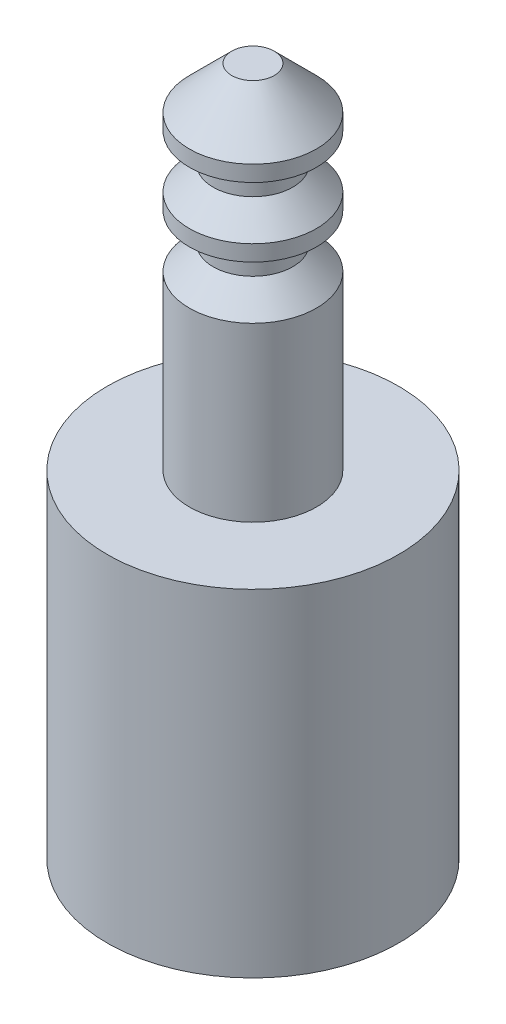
from build123d import *


with BuildPart() as part:
    # Sketch1 → Revolve1 (revolve)
    with BuildSketch(Plane.XY, mode=Mode.PRIVATE) as revolve1_sk:
        Polygon((2.75, 6.35), (1.2, 6.35), (1.2, 9.6), (0.75, 10.05), (0.75, 10.6), (1.2, 10.6), (1.2, 10.9), (0.75, 11.35), (0.75, 11.9), (1.2, 11.9), (1.2, 12.2), (0.4, 13), (0, 13), (0, 0), (2.75, 0), align=None)
    revolve(revolve1_sk.sketch.rotate(Axis((0, 0, 0), (0, -1, 0)), 180), axis=Axis((0, 0, 0), (0, -1, 0)))


solid = part.part
